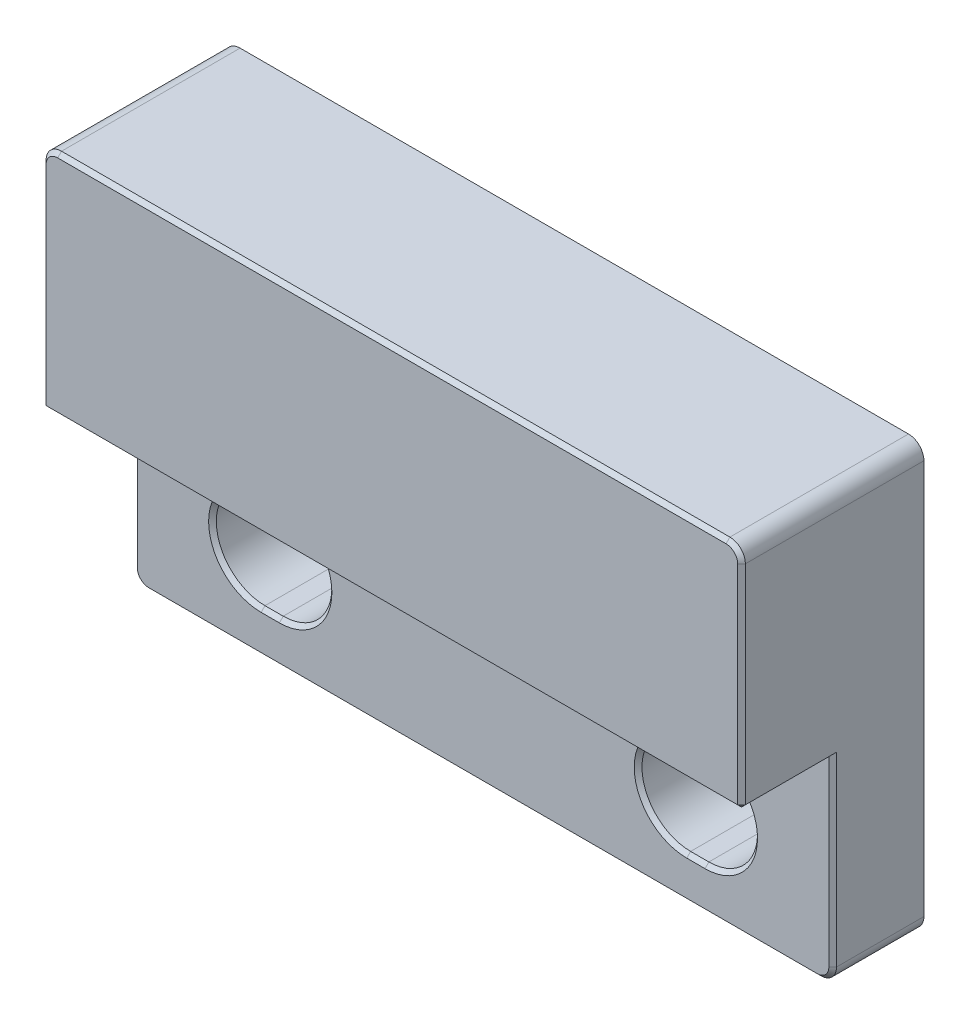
ISO-10303-21;
HEADER;
FILE_DESCRIPTION(('STEP AP214'),'2;1');
FILE_NAME('part.step','',(''),(''),'','','');
FILE_SCHEMA(('AUTOMOTIVE_DESIGN { 1 0 10303 214 1 1 1 1 }'));
ENDSEC;
DATA;
#1=APPLICATION_CONTEXT('core data for automotive mechanical design processes');
#2=APPLICATION_PROTOCOL_DEFINITION('international standard','automotive_design',2000,#1);
#3=PRODUCT_CONTEXT('',#1,'mechanical');
#4=PRODUCT('Part','Part','',(#3));
#5=PRODUCT_RELATED_PRODUCT_CATEGORY('part','',(#4));
#6=PRODUCT_DEFINITION_FORMATION('','',#4);
#7=PRODUCT_DEFINITION_CONTEXT('part definition',#1,'design');
#8=PRODUCT_DEFINITION('design','',#6,#7);
#9=PRODUCT_DEFINITION_SHAPE('','',#8);
#10=(LENGTH_UNIT() NAMED_UNIT(*) SI_UNIT(.MILLI.,.METRE.));
#11=(NAMED_UNIT(*) PLANE_ANGLE_UNIT() SI_UNIT($,.RADIAN.));
#12=(NAMED_UNIT(*) SI_UNIT($,.STERADIAN.) SOLID_ANGLE_UNIT());
#13=UNCERTAINTY_MEASURE_WITH_UNIT(LENGTH_MEASURE(1.E-05),#10,'distance_accuracy_value','');
#14=(GEOMETRIC_REPRESENTATION_CONTEXT(3) GLOBAL_UNCERTAINTY_ASSIGNED_CONTEXT((#13)) GLOBAL_UNIT_ASSIGNED_CONTEXT((#10,
#11,#12)) REPRESENTATION_CONTEXT('',''));
#15=CARTESIAN_POINT('',(0.,0.,0.));
#16=DIRECTION('',(0.,0.,1.));
#17=DIRECTION('',(1.,0.,0.));
#18=AXIS2_PLACEMENT_3D('',#15,#16,#17);
#19=CARTESIAN_POINT('',(0.,6.627,6.));
#20=DIRECTION('',(0.,-0.707106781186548,0.707106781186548));
#21=DIRECTION('',(0.,-0.707106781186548,-0.707106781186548));
#22=AXIS2_PLACEMENT_3D('',#19,#20,#21);
#23=PLANE('',#22);
#24=DIRECTION('',(0.,-0.707106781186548,-0.707106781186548));
#25=VECTOR('',#24,1.);
#26=CARTESIAN_POINT('',(22.873,6.627,6.));
#27=LINE('',#26,#25);
#28=CARTESIAN_POINT('',(22.873,6.5,5.873));
#29=VERTEX_POINT('',#28);
#30=CARTESIAN_POINT('',(22.873,6.627,6.));
#31=VERTEX_POINT('',#30);
#32=EDGE_CURVE('E532',#29,#31,#27,.F.);
#33=ORIENTED_EDGE('',*,*,#32,.T.);
#34=DIRECTION('',(1.,0.,0.));
#35=VECTOR('',#34,1.);
#36=CARTESIAN_POINT('',(0.,6.627,6.));
#37=LINE('',#36,#35);
#38=CARTESIAN_POINT('',(0.126999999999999,6.627,6.));
#39=VERTEX_POINT('',#38);
#40=EDGE_CURVE('E511',#39,#31,#37,.T.);
#41=ORIENTED_EDGE('',*,*,#40,.F.);
#42=DIRECTION('',(0.,0.707106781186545,0.70710678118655));
#43=VECTOR('',#42,1.);
#44=CARTESIAN_POINT('',(0.126999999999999,6.5,5.873));
#45=LINE('',#44,#43);
#46=CARTESIAN_POINT('',(0.126999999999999,6.5,5.873));
#47=VERTEX_POINT('',#46);
#48=EDGE_CURVE('E529',#47,#39,#45,.T.);
#49=ORIENTED_EDGE('',*,*,#48,.F.);
#50=DIRECTION('',(1.,0.,0.));
#51=VECTOR('',#50,1.);
#52=CARTESIAN_POINT('',(0.,6.5,5.873));
#53=LINE('',#52,#51);
#54=EDGE_CURVE('E486',#47,#29,#53,.T.);
#55=ORIENTED_EDGE('',*,*,#54,.T.);
#56=EDGE_LOOP('',(#33,#41,#49,#55));
#57=FACE_BOUND('',#56,.T.);
#58=ADVANCED_FACE('F15',(#57),#23,.T.);
#59=CARTESIAN_POINT('',(4.2,1.4,2.87299999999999));
#60=DIRECTION('',(0.,-0.707106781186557,-0.707106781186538));
#61=DIRECTION('',(0.,0.707106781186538,-0.707106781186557));
#62=AXIS2_PLACEMENT_3D('',#59,#60,#61);
#63=PLANE('',#62);
#64=DIRECTION('',(-1.,0.,0.));
#65=VECTOR('',#64,1.);
#66=CARTESIAN_POINT('',(0.,1.273,3.));
#67=LINE('',#66,#65);
#68=CARTESIAN_POINT('',(4.2,1.27300000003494,2.99999999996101));
#69=VERTEX_POINT('',#68);
#70=CARTESIAN_POINT('',(4.8,1.27300000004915,2.99999999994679));
#71=VERTEX_POINT('',#70);
#72=EDGE_CURVE('E476',#69,#71,#67,.F.);
#73=ORIENTED_EDGE('',*,*,#72,.T.);
#74=DIRECTION('',(0.,0.707106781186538,-0.707106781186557));
#75=VECTOR('',#74,1.);
#76=CARTESIAN_POINT('',(4.79999999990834,-498992.2,498996.473000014));
#77=LINE('',#76,#75);
#78=CARTESIAN_POINT('',(4.8,1.40000000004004,2.87299999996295));
#79=VERTEX_POINT('',#78);
#80=EDGE_CURVE('E451',#71,#79,#77,.T.);
#81=ORIENTED_EDGE('',*,*,#80,.T.);
#82=DIRECTION('',(1.,0.,0.));
#83=VECTOR('',#82,1.);
#84=CARTESIAN_POINT('',(4.2,1.4,2.87299999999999));
#85=LINE('',#84,#83);
#86=CARTESIAN_POINT('',(4.2,1.40000000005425,2.87299999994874));
#87=VERTEX_POINT('',#86);
#88=EDGE_CURVE('E444',#79,#87,#85,.F.);
#89=ORIENTED_EDGE('',*,*,#88,.T.);
#90=DIRECTION('',(0.,0.707106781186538,-0.707106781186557));
#91=VECTOR('',#90,1.);
#92=CARTESIAN_POINT('',(4.19999999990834,-498992.8,498997.073000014));
#93=LINE('',#92,#91);
#94=EDGE_CURVE('E470',#87,#69,#93,.F.);
#95=ORIENTED_EDGE('',*,*,#94,.T.);
#96=EDGE_LOOP('',(#73,#81,#89,#95));
#97=FACE_BOUND('',#96,.T.);
#98=ADVANCED_FACE('F616',(#97),#63,.F.);
#99=CARTESIAN_POINT('',(4.2,4.6,2.87299999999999));
#100=DIRECTION('',(0.,0.707106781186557,-0.707106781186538));
#101=DIRECTION('',(0.,0.707106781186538,0.707106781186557));
#102=AXIS2_PLACEMENT_3D('',#99,#100,#101);
#103=PLANE('',#102);
#104=DIRECTION('',(-1.,0.,0.));
#105=VECTOR('',#104,1.);
#106=CARTESIAN_POINT('',(0.,4.727,3.));
#107=LINE('',#106,#105);
#108=CARTESIAN_POINT('',(4.8,4.72699999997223,2.99999999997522));
#109=VERTEX_POINT('',#108);
#110=CARTESIAN_POINT('',(4.2,4.72699999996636,2.99999999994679));
#111=VERTEX_POINT('',#110);
#112=EDGE_CURVE('E479',#109,#111,#107,.T.);
#113=ORIENTED_EDGE('',*,*,#112,.T.);
#114=DIRECTION('',(0.,-0.707106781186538,-0.707106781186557));
#115=VECTOR('',#114,1.);
#116=CARTESIAN_POINT('',(4.20000000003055,498998.8,498997.073000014));
#117=LINE('',#116,#115);
#118=CARTESIAN_POINT('',(4.2,4.59999999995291,2.87299999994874));
#119=VERTEX_POINT('',#118);
#120=EDGE_CURVE('E458',#111,#119,#117,.T.);
#121=ORIENTED_EDGE('',*,*,#120,.T.);
#122=DIRECTION('',(1.,0.,0.));
#123=VECTOR('',#122,1.);
#124=CARTESIAN_POINT('',(4.2,4.6,2.87299999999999));
#125=LINE('',#124,#123);
#126=CARTESIAN_POINT('',(4.8,4.59999999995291,2.87299999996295));
#127=VERTEX_POINT('',#126);
#128=EDGE_CURVE('E439',#119,#127,#125,.T.);
#129=ORIENTED_EDGE('',*,*,#128,.T.);
#130=DIRECTION('',(0.,-0.707106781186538,-0.707106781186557));
#131=VECTOR('',#130,1.);
#132=CARTESIAN_POINT('',(4.79999999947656,498998.2,498996.473000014));
#133=LINE('',#132,#131);
#134=EDGE_CURVE('E437',#127,#109,#133,.F.);
#135=ORIENTED_EDGE('',*,*,#134,.T.);
#136=EDGE_LOOP('',(#113,#121,#129,#135));
#137=FACE_BOUND('',#136,.T.);
#138=ADVANCED_FACE('F640',(#137),#103,.F.);
#139=CARTESIAN_POINT('',(18.2,1.4,2.87299999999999));
#140=DIRECTION('',(0.,-0.707106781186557,-0.707106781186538));
#141=DIRECTION('',(0.,0.707106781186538,-0.707106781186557));
#142=AXIS2_PLACEMENT_3D('',#139,#140,#141);
#143=PLANE('',#142);
#144=DIRECTION('',(-1.,0.,0.));
#145=VECTOR('',#144,1.);
#146=CARTESIAN_POINT('',(0.,1.273,3.));
#147=LINE('',#146,#145);
#148=CARTESIAN_POINT('',(18.2,1.27300000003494,3.00000000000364));
#149=VERTEX_POINT('',#148);
#150=CARTESIAN_POINT('',(18.8,1.27300000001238,2.99999999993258));
#151=VERTEX_POINT('',#150);
#152=EDGE_CURVE('E481',#149,#151,#147,.F.);
#153=ORIENTED_EDGE('',*,*,#152,.T.);
#154=DIRECTION('',(0.,0.707106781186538,-0.707106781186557));
#155=VECTOR('',#154,1.);
#156=CARTESIAN_POINT('',(18.7999999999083,-498978.2,498982.473000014));
#157=LINE('',#156,#155);
#158=CARTESIAN_POINT('',(18.8,1.40000000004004,2.87299999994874));
#159=VERTEX_POINT('',#158);
#160=EDGE_CURVE('E409',#151,#159,#157,.T.);
#161=ORIENTED_EDGE('',*,*,#160,.T.);
#162=DIRECTION('',(1.,0.,0.));
#163=VECTOR('',#162,1.);
#164=CARTESIAN_POINT('',(18.2,1.4,2.87299999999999));
#165=LINE('',#164,#163);
#166=CARTESIAN_POINT('',(18.2,1.40000000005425,2.87299999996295));
#167=VERTEX_POINT('',#166);
#168=EDGE_CURVE('E402',#159,#167,#165,.F.);
#169=ORIENTED_EDGE('',*,*,#168,.T.);
#170=DIRECTION('',(0.,0.707106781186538,-0.707106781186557));
#171=VECTOR('',#170,1.);
#172=CARTESIAN_POINT('',(18.1999999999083,-498978.8,498983.073000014));
#173=LINE('',#172,#171);
#174=EDGE_CURVE('E428',#167,#149,#173,.F.);
#175=ORIENTED_EDGE('',*,*,#174,.T.);
#176=EDGE_LOOP('',(#153,#161,#169,#175));
#177=FACE_BOUND('',#176,.T.);
#178=ADVANCED_FACE('F782',(#177),#143,.F.);
#179=CARTESIAN_POINT('',(18.2,4.6,2.87299999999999));
#180=DIRECTION('',(0.,0.707106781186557,-0.707106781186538));
#181=DIRECTION('',(0.,0.707106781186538,0.707106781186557));
#182=AXIS2_PLACEMENT_3D('',#179,#180,#181);
#183=PLANE('',#182);
#184=DIRECTION('',(-1.,0.,0.));
#185=VECTOR('',#184,1.);
#186=CARTESIAN_POINT('',(0.,4.727,3.));
#187=LINE('',#186,#185);
#188=CARTESIAN_POINT('',(18.8,4.72700000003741,3.00000000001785));
#189=VERTEX_POINT('',#188);
#190=CARTESIAN_POINT('',(18.2,4.72699999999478,3.00000000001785));
#191=VERTEX_POINT('',#190);
#192=EDGE_CURVE('E484',#189,#191,#187,.T.);
#193=ORIENTED_EDGE('',*,*,#192,.T.);
#194=DIRECTION('',(0.,-0.707106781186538,-0.707106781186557));
#195=VECTOR('',#194,1.);
#196=CARTESIAN_POINT('',(18.2000000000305,498984.8,498983.073000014));
#197=LINE('',#196,#195);
#198=CARTESIAN_POINT('',(18.2,4.59999999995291,2.87299999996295));
#199=VERTEX_POINT('',#198);
#200=EDGE_CURVE('E416',#191,#199,#197,.T.);
#201=ORIENTED_EDGE('',*,*,#200,.T.);
#202=DIRECTION('',(1.,0.,0.));
#203=VECTOR('',#202,1.);
#204=CARTESIAN_POINT('',(18.2,4.6,2.87299999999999));
#205=LINE('',#204,#203);
#206=CARTESIAN_POINT('',(18.8,4.59999999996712,2.87299999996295));
#207=VERTEX_POINT('',#206);
#208=EDGE_CURVE('E397',#199,#207,#205,.T.);
#209=ORIENTED_EDGE('',*,*,#208,.T.);
#210=DIRECTION('',(0.,-0.707106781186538,-0.707106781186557));
#211=VECTOR('',#210,1.);
#212=CARTESIAN_POINT('',(18.8000000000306,498984.2,498982.473000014));
#213=LINE('',#212,#211);
#214=EDGE_CURVE('E394',#207,#189,#213,.F.);
#215=ORIENTED_EDGE('',*,*,#214,.T.);
#216=EDGE_LOOP('',(#193,#201,#209,#215));
#217=FACE_BOUND('',#216,.T.);
#218=ADVANCED_FACE('F778',(#217),#183,.F.);
#219=CARTESIAN_POINT('',(0.126999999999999,6.5,5.873));
#220=DIRECTION('',(-0.577350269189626,-0.577350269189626,0.577350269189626));
#221=DIRECTION('',(0.707106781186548,0.,0.707106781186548));
#222=AXIS2_PLACEMENT_3D('',#219,#220,#221);
#223=PLANE('',#222);
#224=DIRECTION('',(-0.707106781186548,0.707106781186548,0.));
#225=VECTOR('',#224,1.);
#226=CARTESIAN_POINT('',(0.126999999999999,6.5,5.873));
#227=LINE('',#226,#225);
#228=CARTESIAN_POINT('',(0.,6.627,5.873));
#229=VERTEX_POINT('',#228);
#230=EDGE_CURVE('E353',#229,#47,#227,.F.);
#231=ORIENTED_EDGE('',*,*,#230,.T.);
#232=ORIENTED_EDGE('',*,*,#48,.T.);
#233=DIRECTION('',(0.707106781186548,0.,0.707106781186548));
#234=VECTOR('',#233,1.);
#235=CARTESIAN_POINT('',(0.126999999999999,6.627,6.));
#236=LINE('',#235,#234);
#237=EDGE_CURVE('E363',#229,#39,#236,.T.);
#238=ORIENTED_EDGE('',*,*,#237,.F.);
#239=EDGE_LOOP('',(#231,#232,#238));
#240=FACE_BOUND('',#239,.T.);
#241=ADVANCED_FACE('F775',(#240),#223,.T.);
#242=CARTESIAN_POINT('',(0.508,13.492,5.87299999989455));
#243=DIRECTION('',(0.,0.,-1.));
#244=DIRECTION('',(0.,1.,0.));
#245=AXIS2_PLACEMENT_3D('',#242,#243,#244);
#246=CONICAL_SURFACE('',#245,0.508,0.785398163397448);
#247=DIRECTION('',(0.707106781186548,0.,0.707106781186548));
#248=VECTOR('',#247,1.);
#249=CARTESIAN_POINT('',(0.126999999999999,13.492,6.));
#250=LINE('',#249,#248);
#251=CARTESIAN_POINT('',(0.12699999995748,13.492,5.99999999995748));
#252=VERTEX_POINT('',#251);
#253=CARTESIAN_POINT('',(0.,13.492,5.873));
#254=VERTEX_POINT('',#253);
#255=EDGE_CURVE('E360',#252,#254,#250,.F.);
#256=ORIENTED_EDGE('',*,*,#255,.F.);
#257=CARTESIAN_POINT('',(0.508,13.492,5.99999999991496));
#258=DIRECTION('',(0.,0.,-1.));
#259=DIRECTION('',(0.,1.,0.));
#260=AXIS2_PLACEMENT_3D('',#257,#258,#259);
#261=CIRCLE('',#260,0.380999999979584);
#262=CARTESIAN_POINT('',(0.508,13.8730000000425,5.99999999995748));
#263=VERTEX_POINT('',#262);
#264=EDGE_CURVE('E18',#263,#252,#261,.F.);
#265=ORIENTED_EDGE('',*,*,#264,.F.);
#266=DIRECTION('',(0.,-0.707106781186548,0.707106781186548));
#267=VECTOR('',#266,1.);
#268=CARTESIAN_POINT('',(0.508,13.873,6.));
#269=LINE('',#268,#267);
#270=CARTESIAN_POINT('',(0.508,14.,5.873));
#271=VERTEX_POINT('',#270);
#272=EDGE_CURVE('E349',#271,#263,#269,.T.);
#273=ORIENTED_EDGE('',*,*,#272,.F.);
#274=CARTESIAN_POINT('',(0.508,13.492,5.873));
#275=DIRECTION('',(0.,0.,-1.));
#276=DIRECTION('',(-1.,0.,0.));
#277=AXIS2_PLACEMENT_3D('',#274,#275,#276);
#278=CIRCLE('',#277,0.508);
#279=EDGE_CURVE('E339',#254,#271,#278,.T.);
#280=ORIENTED_EDGE('',*,*,#279,.F.);
#281=EDGE_LOOP('',(#256,#265,#273,#280));
#282=FACE_BOUND('',#281,.T.);
#283=ADVANCED_FACE('F772',(#282),#246,.T.);
#284=CARTESIAN_POINT('',(0.,0.,6.));
#285=DIRECTION('',(0.,0.,1.));
#286=DIRECTION('',(1.,0.,0.));
#287=AXIS2_PLACEMENT_3D('',#284,#285,#286);
#288=PLANE('',#287);
#289=DIRECTION('',(0.,1.,0.));
#290=VECTOR('',#289,1.);
#291=CARTESIAN_POINT('',(0.126999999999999,0.,6.));
#292=LINE('',#291,#290);
#293=EDGE_CURVE('E522',#39,#252,#292,.T.);
#294=ORIENTED_EDGE('',*,*,#293,.F.);
#295=ORIENTED_EDGE('',*,*,#40,.T.);
#296=DIRECTION('',(0.,1.,0.));
#297=VECTOR('',#296,1.);
#298=CARTESIAN_POINT('',(22.873,0.,6.));
#299=LINE('',#298,#297);
#300=CARTESIAN_POINT('',(22.8730000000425,13.492,5.99999999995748));
#301=VERTEX_POINT('',#300);
#302=EDGE_CURVE('E322',#301,#31,#299,.F.);
#303=ORIENTED_EDGE('',*,*,#302,.F.);
#304=CARTESIAN_POINT('',(22.492,13.492,5.99999999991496));
#305=DIRECTION('',(0.,0.,-1.));
#306=DIRECTION('',(-1.,0.,0.));
#307=AXIS2_PLACEMENT_3D('',#304,#305,#306);
#308=CIRCLE('',#307,0.381000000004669);
#309=CARTESIAN_POINT('',(22.492,13.8730000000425,5.99999999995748));
#310=VERTEX_POINT('',#309);
#311=EDGE_CURVE('E493',#310,#301,#308,.T.);
#312=ORIENTED_EDGE('',*,*,#311,.F.);
#313=DIRECTION('',(1.,0.,0.));
#314=VECTOR('',#313,1.);
#315=CARTESIAN_POINT('',(0.,13.873,6.));
#316=LINE('',#315,#314);
#317=EDGE_CURVE('E352',#263,#310,#316,.T.);
#318=ORIENTED_EDGE('',*,*,#317,.F.);
#319=ORIENTED_EDGE('',*,*,#264,.T.);
#320=EDGE_LOOP('',(#294,#295,#303,#312,#318,#319));
#321=FACE_BOUND('',#320,.T.);
#322=ADVANCED_FACE('F575',(#321),#288,.T.);
#323=CARTESIAN_POINT('',(22.492,13.492,5.87300000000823));
#324=DIRECTION('',(0.,0.,-1.));
#325=DIRECTION('',(-1.,0.,0.));
#326=AXIS2_PLACEMENT_3D('',#323,#324,#325);
#327=CONICAL_SURFACE('',#326,0.507999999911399,0.785398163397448);
#328=DIRECTION('',(0.707106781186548,0.,-0.707106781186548));
#329=VECTOR('',#328,1.);
#330=CARTESIAN_POINT('',(22.873,13.492,6.));
#331=LINE('',#330,#329);
#332=CARTESIAN_POINT('',(23.,13.492,5.873));
#333=VERTEX_POINT('',#332);
#334=EDGE_CURVE('E319',#333,#301,#331,.F.);
#335=ORIENTED_EDGE('',*,*,#334,.F.);
#336=CARTESIAN_POINT('',(22.492,13.492,5.873));
#337=DIRECTION('',(0.,0.,-1.));
#338=DIRECTION('',(-1.,0.,0.));
#339=AXIS2_PLACEMENT_3D('',#336,#337,#338);
#340=CIRCLE('',#339,0.508000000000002);
#341=CARTESIAN_POINT('',(22.492,14.,5.873));
#342=VERTEX_POINT('',#341);
#343=EDGE_CURVE('E309',#342,#333,#340,.T.);
#344=ORIENTED_EDGE('',*,*,#343,.F.);
#345=DIRECTION('',(0.,-0.707106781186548,0.707106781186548));
#346=VECTOR('',#345,1.);
#347=CARTESIAN_POINT('',(22.492,13.873,6.));
#348=LINE('',#347,#346);
#349=EDGE_CURVE('E342',#310,#342,#348,.F.);
#350=ORIENTED_EDGE('',*,*,#349,.F.);
#351=ORIENTED_EDGE('',*,*,#311,.T.);
#352=EDGE_LOOP('',(#335,#344,#350,#351));
#353=FACE_BOUND('',#352,.T.);
#354=ADVANCED_FACE('F570',(#353),#327,.T.);
#355=CARTESIAN_POINT('',(0.,6.5,6.));
#356=DIRECTION('',(0.,1.,0.));
#357=DIRECTION('',(0.,0.,1.));
#358=AXIS2_PLACEMENT_3D('',#355,#356,#357);
#359=PLANE('',#358);
#360=DIRECTION('',(0.,0.,1.));
#361=VECTOR('',#360,1.);
#362=CARTESIAN_POINT('',(22.873,6.5,3.));
#363=LINE('',#362,#361);
#364=CARTESIAN_POINT('',(22.873,6.5,3.));
#365=VERTEX_POINT('',#364);
#366=EDGE_CURVE('E336',#365,#29,#363,.T.);
#367=ORIENTED_EDGE('',*,*,#366,.T.);
#368=ORIENTED_EDGE('',*,*,#54,.F.);
#369=DIRECTION('',(0.,0.,1.));
#370=VECTOR('',#369,1.);
#371=CARTESIAN_POINT('',(0.126999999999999,6.5,6.));
#372=LINE('',#371,#370);
#373=CARTESIAN_POINT('',(0.126999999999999,6.5,3.));
#374=VERTEX_POINT('',#373);
#375=EDGE_CURVE('E387',#47,#374,#372,.F.);
#376=ORIENTED_EDGE('',*,*,#375,.T.);
#377=DIRECTION('',(-1.,0.,0.));
#378=VECTOR('',#377,1.);
#379=CARTESIAN_POINT('',(0.,6.5,3.));
#380=LINE('',#379,#378);
#381=EDGE_CURVE('E113',#374,#365,#380,.F.);
#382=ORIENTED_EDGE('',*,*,#381,.T.);
#383=EDGE_LOOP('',(#367,#368,#376,#382));
#384=FACE_BOUND('',#383,.T.);
#385=ADVANCED_FACE('F763',(#384),#359,.F.);
#386=CARTESIAN_POINT('',(23.,6.627,5.873));
#387=DIRECTION('',(0.577350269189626,-0.577350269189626,0.577350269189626));
#388=DIRECTION('',(0.707106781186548,0.,-0.707106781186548));
#389=AXIS2_PLACEMENT_3D('',#386,#387,#388);
#390=PLANE('',#389);
#391=ORIENTED_EDGE('',*,*,#32,.F.);
#392=DIRECTION('',(-0.707106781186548,-0.707106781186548,0.));
#393=VECTOR('',#392,1.);
#394=CARTESIAN_POINT('',(23.,6.627,5.873));
#395=LINE('',#394,#393);
#396=CARTESIAN_POINT('',(23.,6.627,5.873));
#397=VERTEX_POINT('',#396);
#398=EDGE_CURVE('E296',#29,#397,#395,.F.);
#399=ORIENTED_EDGE('',*,*,#398,.T.);
#400=DIRECTION('',(0.707106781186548,0.,-0.707106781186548));
#401=VECTOR('',#400,1.);
#402=CARTESIAN_POINT('',(22.873,6.627,6.));
#403=LINE('',#402,#401);
#404=EDGE_CURVE('E312',#31,#397,#403,.T.);
#405=ORIENTED_EDGE('',*,*,#404,.F.);
#406=EDGE_LOOP('',(#391,#399,#405));
#407=FACE_BOUND('',#406,.T.);
#408=ADVANCED_FACE('F760',(#407),#390,.T.);
#409=CARTESIAN_POINT('',(0.,0.,3.));
#410=DIRECTION('',(0.,0.,-1.));
#411=DIRECTION('',(-1.,0.,0.));
#412=AXIS2_PLACEMENT_3D('',#409,#410,#411);
#413=PLANE('',#412);
#414=DIRECTION('',(0.,1.,0.));
#415=VECTOR('',#414,1.);
#416=CARTESIAN_POINT('',(22.873,0.,3.));
#417=LINE('',#416,#415);
#418=CARTESIAN_POINT('',(22.8729999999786,0.508,3.00000000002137));
#419=VERTEX_POINT('',#418);
#420=EDGE_CURVE('E303',#419,#365,#417,.T.);
#421=ORIENTED_EDGE('',*,*,#420,.T.);
#422=ORIENTED_EDGE('',*,*,#381,.F.);
#423=DIRECTION('',(0.,1.,0.));
#424=VECTOR('',#423,1.);
#425=CARTESIAN_POINT('',(0.126999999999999,0.,3.));
#426=LINE('',#425,#424);
#427=CARTESIAN_POINT('',(0.126999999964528,0.508,2.99999999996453));
#428=VERTEX_POINT('',#427);
#429=EDGE_CURVE('E377',#374,#428,#426,.F.);
#430=ORIENTED_EDGE('',*,*,#429,.T.);
#431=CARTESIAN_POINT('',(0.508,0.508,2.99999999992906));
#432=DIRECTION('',(0.,0.,-1.));
#433=DIRECTION('',(-1.,0.,0.));
#434=AXIS2_PLACEMENT_3D('',#431,#432,#433);
#435=CIRCLE('',#434,0.380999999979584);
#436=CARTESIAN_POINT('',(0.508,0.126999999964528,2.99999999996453));
#437=VERTEX_POINT('',#436);
#438=EDGE_CURVE('E504',#437,#428,#435,.T.);
#439=ORIENTED_EDGE('',*,*,#438,.F.);
#440=DIRECTION('',(1.,0.,0.));
#441=VECTOR('',#440,1.);
#442=CARTESIAN_POINT('',(0.,0.126999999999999,3.));
#443=LINE('',#442,#441);
#444=CARTESIAN_POINT('',(22.492,0.127000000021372,3.00000000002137));
#445=VERTEX_POINT('',#444);
#446=EDGE_CURVE('E286',#437,#445,#443,.T.);
#447=ORIENTED_EDGE('',*,*,#446,.T.);
#448=CARTESIAN_POINT('',(22.492,0.508,3.00000000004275));
#449=DIRECTION('',(0.,0.,-1.));
#450=DIRECTION('',(-1.,0.,0.));
#451=AXIS2_PLACEMENT_3D('',#448,#449,#450);
#452=CIRCLE('',#451,0.381000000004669);
#453=EDGE_CURVE('E472',#419,#445,#452,.T.);
#454=ORIENTED_EDGE('',*,*,#453,.F.);
#455=EDGE_LOOP('',(#421,#422,#430,#439,#447,#454));
#456=FACE_BOUND('',#455,.T.);
#457=CARTESIAN_POINT('',(4.8,3.,2.9999999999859));
#458=DIRECTION('',(0.,0.,1.));
#459=DIRECTION('',(1.,0.,0.));
#460=AXIS2_PLACEMENT_3D('',#457,#458,#459);
#461=CIRCLE('',#460,1.72699999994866);
#462=EDGE_CURVE('E430',#109,#71,#461,.F.);
#463=ORIENTED_EDGE('',*,*,#462,.T.);
#464=ORIENTED_EDGE('',*,*,#72,.F.);
#465=CARTESIAN_POINT('',(4.2,3.,2.9999999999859));
#466=DIRECTION('',(0.,0.,1.));
#467=DIRECTION('',(1.,0.,0.));
#468=AXIS2_PLACEMENT_3D('',#465,#466,#467);
#469=CIRCLE('',#468,1.72699999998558);
#470=EDGE_CURVE('E467',#69,#111,#469,.F.);
#471=ORIENTED_EDGE('',*,*,#470,.T.);
#472=ORIENTED_EDGE('',*,*,#112,.F.);
#473=EDGE_LOOP('',(#463,#464,#471,#472));
#474=FACE_BOUND('',#473,.T.);
#475=CARTESIAN_POINT('',(18.8,3.,3.00000000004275));
#476=DIRECTION('',(0.,0.,1.));
#477=DIRECTION('',(0.,-1.,0.));
#478=AXIS2_PLACEMENT_3D('',#475,#476,#477);
#479=CIRCLE('',#478,1.72700000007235);
#480=EDGE_CURVE('E396',#189,#151,#479,.F.);
#481=ORIENTED_EDGE('',*,*,#480,.T.);
#482=ORIENTED_EDGE('',*,*,#152,.F.);
#483=CARTESIAN_POINT('',(18.2,3.,3.00000000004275));
#484=DIRECTION('',(0.,0.,1.));
#485=DIRECTION('',(0.,-1.,0.));
#486=AXIS2_PLACEMENT_3D('',#483,#484,#485);
#487=CIRCLE('',#486,1.72699999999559);
#488=EDGE_CURVE('E425',#149,#191,#487,.F.);
#489=ORIENTED_EDGE('',*,*,#488,.T.);
#490=ORIENTED_EDGE('',*,*,#192,.F.);
#491=EDGE_LOOP('',(#481,#482,#489,#490));
#492=FACE_BOUND('',#491,.T.);
#493=ADVANCED_FACE('F644',(#456,#474,#492),#413,.F.);
#494=CARTESIAN_POINT('',(0.508,0.508,2.87300000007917));
#495=DIRECTION('',(0.,0.,-1.));
#496=DIRECTION('',(-1.,0.,0.));
#497=AXIS2_PLACEMENT_3D('',#494,#495,#496);
#498=CONICAL_SURFACE('',#497,0.507999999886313,0.785398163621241);
#499=DIRECTION('',(0.,0.707106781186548,0.707106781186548));
#500=VECTOR('',#499,1.);
#501=CARTESIAN_POINT('',(0.508,0.126999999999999,3.));
#502=LINE('',#501,#500);
#503=CARTESIAN_POINT('',(0.508,0.,2.873));
#504=VERTEX_POINT('',#503);
#505=EDGE_CURVE('E276',#504,#437,#502,.T.);
#506=ORIENTED_EDGE('',*,*,#505,.T.);
#507=ORIENTED_EDGE('',*,*,#438,.T.);
#508=DIRECTION('',(-0.707106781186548,0.,-0.707106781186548));
#509=VECTOR('',#508,1.);
#510=CARTESIAN_POINT('',(0.126999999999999,0.508,3.));
#511=LINE('',#510,#509);
#512=CARTESIAN_POINT('',(0.,0.508,2.873));
#513=VERTEX_POINT('',#512);
#514=EDGE_CURVE('E364',#428,#513,#511,.T.);
#515=ORIENTED_EDGE('',*,*,#514,.T.);
#516=CARTESIAN_POINT('',(0.508,0.508,2.873));
#517=DIRECTION('',(0.,0.,-1.));
#518=DIRECTION('',(-1.,0.,0.));
#519=AXIS2_PLACEMENT_3D('',#516,#517,#518);
#520=CIRCLE('',#519,0.508);
#521=EDGE_CURVE('E293',#504,#513,#520,.T.);
#522=ORIENTED_EDGE('',*,*,#521,.F.);
#523=EDGE_LOOP('',(#506,#507,#515,#522));
#524=FACE_BOUND('',#523,.T.);
#525=ADVANCED_FACE('F753',(#524),#498,.T.);
#526=CARTESIAN_POINT('',(22.492,0.508,2.87300000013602));
#527=DIRECTION('',(0.,0.,-1.));
#528=DIRECTION('',(-1.,0.,0.));
#529=AXIS2_PLACEMENT_3D('',#526,#527,#528);
#530=CONICAL_SURFACE('',#529,0.507999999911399,0.785398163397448);
#531=DIRECTION('',(-0.707106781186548,0.,0.707106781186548));
#532=VECTOR('',#531,1.);
#533=CARTESIAN_POINT('',(22.873,0.508,3.));
#534=LINE('',#533,#532);
#535=CARTESIAN_POINT('',(23.,0.508,2.873));
#536=VERTEX_POINT('',#535);
#537=EDGE_CURVE('E299',#536,#419,#534,.T.);
#538=ORIENTED_EDGE('',*,*,#537,.T.);
#539=ORIENTED_EDGE('',*,*,#453,.T.);
#540=DIRECTION('',(0.,0.707106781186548,0.707106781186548));
#541=VECTOR('',#540,1.);
#542=CARTESIAN_POINT('',(22.492,0.126999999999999,3.));
#543=LINE('',#542,#541);
#544=CARTESIAN_POINT('',(22.492,0.,2.873));
#545=VERTEX_POINT('',#544);
#546=EDGE_CURVE('E283',#445,#545,#543,.F.);
#547=ORIENTED_EDGE('',*,*,#546,.T.);
#548=CARTESIAN_POINT('',(22.492,0.508,2.873));
#549=DIRECTION('',(0.,0.,-1.));
#550=DIRECTION('',(-1.,0.,0.));
#551=AXIS2_PLACEMENT_3D('',#548,#549,#550);
#552=CIRCLE('',#551,0.508000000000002);
#553=EDGE_CURVE('E168',#536,#545,#552,.T.);
#554=ORIENTED_EDGE('',*,*,#553,.F.);
#555=EDGE_LOOP('',(#538,#539,#547,#554));
#556=FACE_BOUND('',#555,.T.);
#557=ADVANCED_FACE('F750',(#556),#530,.T.);
#558=CARTESIAN_POINT('',(4.2,3.,2.99999999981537));
#559=DIRECTION('',(0.,0.,1.));
#560=DIRECTION('',(1.,0.,0.));
#561=AXIS2_PLACEMENT_3D('',#558,#559,#560);
#562=CONICAL_SURFACE('',#561,1.72699999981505,0.785398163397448);
#563=ORIENTED_EDGE('',*,*,#470,.F.);
#564=ORIENTED_EDGE('',*,*,#94,.F.);
#565=CARTESIAN_POINT('',(4.2,3.,2.87299999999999));
#566=DIRECTION('',(0.,0.,1.));
#567=DIRECTION('',(1.,0.,0.));
#568=AXIS2_PLACEMENT_3D('',#565,#566,#567);
#569=CIRCLE('',#568,1.6);
#570=EDGE_CURVE('E268',#87,#119,#569,.F.);
#571=ORIENTED_EDGE('',*,*,#570,.T.);
#572=ORIENTED_EDGE('',*,*,#120,.F.);
#573=EDGE_LOOP('',(#563,#564,#571,#572));
#574=FACE_BOUND('',#573,.T.);
#575=ADVANCED_FACE('F629',(#574),#562,.F.);
#576=CARTESIAN_POINT('',(4.2,1.4,0.));
#577=DIRECTION('',(0.,-1.,0.));
#578=DIRECTION('',(1.,0.,0.));
#579=AXIS2_PLACEMENT_3D('',#576,#577,#578);
#580=PLANE('',#579);
#581=ORIENTED_EDGE('',*,*,#88,.F.);
#582=DIRECTION('',(0.,0.,1.));
#583=VECTOR('',#582,1.);
#584=CARTESIAN_POINT('',(4.8,1.4,0.));
#585=LINE('',#584,#583);
#586=CARTESIAN_POINT('',(4.8,1.4,0.));
#587=VERTEX_POINT('',#586);
#588=EDGE_CURVE('E258',#79,#587,#585,.F.);
#589=ORIENTED_EDGE('',*,*,#588,.T.);
#590=DIRECTION('',(1.,0.,0.));
#591=VECTOR('',#590,1.);
#592=CARTESIAN_POINT('',(4.2,1.4,0.));
#593=LINE('',#592,#591);
#594=CARTESIAN_POINT('',(4.2,1.4,0.));
#595=VERTEX_POINT('',#594);
#596=EDGE_CURVE('E449',#595,#587,#593,.T.);
#597=ORIENTED_EDGE('',*,*,#596,.F.);
#598=DIRECTION('',(0.,0.,1.));
#599=VECTOR('',#598,1.);
#600=CARTESIAN_POINT('',(4.2,1.4,0.));
#601=LINE('',#600,#599);
#602=EDGE_CURVE('E167',#595,#87,#601,.T.);
#603=ORIENTED_EDGE('',*,*,#602,.T.);
#604=EDGE_LOOP('',(#581,#589,#597,#603));
#605=FACE_BOUND('',#604,.T.);
#606=ADVANCED_FACE('F623',(#605),#580,.F.);
#607=CARTESIAN_POINT('',(4.2,4.6,0.));
#608=DIRECTION('',(0.,1.,0.));
#609=DIRECTION('',(0.,0.,1.));
#610=AXIS2_PLACEMENT_3D('',#607,#608,#609);
#611=PLANE('',#610);
#612=ORIENTED_EDGE('',*,*,#128,.F.);
#613=DIRECTION('',(0.,0.,1.));
#614=VECTOR('',#613,1.);
#615=CARTESIAN_POINT('',(4.2,4.6,0.));
#616=LINE('',#615,#614);
#617=CARTESIAN_POINT('',(4.2,4.6,0.));
#618=VERTEX_POINT('',#617);
#619=EDGE_CURVE('E263',#119,#618,#616,.F.);
#620=ORIENTED_EDGE('',*,*,#619,.T.);
#621=DIRECTION('',(1.,0.,0.));
#622=VECTOR('',#621,1.);
#623=CARTESIAN_POINT('',(4.2,4.6,0.));
#624=LINE('',#623,#622);
#625=CARTESIAN_POINT('',(4.8,4.6,0.));
#626=VERTEX_POINT('',#625);
#627=EDGE_CURVE('E442',#626,#618,#624,.F.);
#628=ORIENTED_EDGE('',*,*,#627,.F.);
#629=DIRECTION('',(0.,0.,1.));
#630=VECTOR('',#629,1.);
#631=CARTESIAN_POINT('',(4.8,4.6,0.));
#632=LINE('',#631,#630);
#633=EDGE_CURVE('E255',#626,#127,#632,.T.);
#634=ORIENTED_EDGE('',*,*,#633,.T.);
#635=EDGE_LOOP('',(#612,#620,#628,#634));
#636=FACE_BOUND('',#635,.T.);
#637=ADVANCED_FACE('F636',(#636),#611,.F.);
#638=CARTESIAN_POINT('',(4.8,3.,2.99999999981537));
#639=DIRECTION('',(0.,0.,1.));
#640=DIRECTION('',(1.,0.,0.));
#641=AXIS2_PLACEMENT_3D('',#638,#639,#640);
#642=CONICAL_SURFACE('',#641,1.72699999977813,0.785398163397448);
#643=CARTESIAN_POINT('',(4.8,3.,2.87299999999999));
#644=DIRECTION('',(0.,0.,1.));
#645=DIRECTION('',(1.,0.,0.));
#646=AXIS2_PLACEMENT_3D('',#643,#644,#645);
#647=CIRCLE('',#646,1.6);
#648=EDGE_CURVE('E252',#127,#79,#647,.F.);
#649=ORIENTED_EDGE('',*,*,#648,.T.);
#650=ORIENTED_EDGE('',*,*,#80,.F.);
#651=ORIENTED_EDGE('',*,*,#462,.F.);
#652=ORIENTED_EDGE('',*,*,#134,.F.);
#653=EDGE_LOOP('',(#649,#650,#651,#652));
#654=FACE_BOUND('',#653,.T.);
#655=ADVANCED_FACE('F647',(#654),#642,.F.);
#656=CARTESIAN_POINT('',(18.2,3.,2.99999999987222));
#657=DIRECTION('',(0.,0.,1.));
#658=DIRECTION('',(0.,-1.,0.));
#659=AXIS2_PLACEMENT_3D('',#656,#657,#658);
#660=CONICAL_SURFACE('',#659,1.72699999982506,0.785398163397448);
#661=ORIENTED_EDGE('',*,*,#488,.F.);
#662=ORIENTED_EDGE('',*,*,#174,.F.);
#663=CARTESIAN_POINT('',(18.2,3.,2.87299999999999));
#664=DIRECTION('',(0.,0.,1.));
#665=DIRECTION('',(1.,0.,0.));
#666=AXIS2_PLACEMENT_3D('',#663,#664,#665);
#667=CIRCLE('',#666,1.6);
#668=EDGE_CURVE('E246',#167,#199,#667,.F.);
#669=ORIENTED_EDGE('',*,*,#668,.T.);
#670=ORIENTED_EDGE('',*,*,#200,.F.);
#671=EDGE_LOOP('',(#661,#662,#669,#670));
#672=FACE_BOUND('',#671,.T.);
#673=ADVANCED_FACE('F737',(#672),#660,.F.);
#674=CARTESIAN_POINT('',(18.2,1.4,0.));
#675=DIRECTION('',(0.,-1.,0.));
#676=DIRECTION('',(1.,0.,0.));
#677=AXIS2_PLACEMENT_3D('',#674,#675,#676);
#678=PLANE('',#677);
#679=ORIENTED_EDGE('',*,*,#168,.F.);
#680=DIRECTION('',(0.,0.,1.));
#681=VECTOR('',#680,1.);
#682=CARTESIAN_POINT('',(18.8,1.4,0.));
#683=LINE('',#682,#681);
#684=CARTESIAN_POINT('',(18.8,1.4,0.));
#685=VERTEX_POINT('',#684);
#686=EDGE_CURVE('E236',#159,#685,#683,.F.);
#687=ORIENTED_EDGE('',*,*,#686,.T.);
#688=DIRECTION('',(1.,0.,0.));
#689=VECTOR('',#688,1.);
#690=CARTESIAN_POINT('',(18.2,1.4,0.));
#691=LINE('',#690,#689);
#692=CARTESIAN_POINT('',(18.2,1.4,0.));
#693=VERTEX_POINT('',#692);
#694=EDGE_CURVE('E407',#693,#685,#691,.T.);
#695=ORIENTED_EDGE('',*,*,#694,.F.);
#696=DIRECTION('',(0.,0.,1.));
#697=VECTOR('',#696,1.);
#698=CARTESIAN_POINT('',(18.2,1.4,0.));
#699=LINE('',#698,#697);
#700=EDGE_CURVE('E249',#693,#167,#699,.T.);
#701=ORIENTED_EDGE('',*,*,#700,.T.);
#702=EDGE_LOOP('',(#679,#687,#695,#701));
#703=FACE_BOUND('',#702,.T.);
#704=ADVANCED_FACE('F733',(#703),#678,.F.);
#705=CARTESIAN_POINT('',(18.2,4.6,0.));
#706=DIRECTION('',(0.,1.,0.));
#707=DIRECTION('',(0.,0.,1.));
#708=AXIS2_PLACEMENT_3D('',#705,#706,#707);
#709=PLANE('',#708);
#710=ORIENTED_EDGE('',*,*,#208,.F.);
#711=DIRECTION('',(0.,0.,1.));
#712=VECTOR('',#711,1.);
#713=CARTESIAN_POINT('',(18.2,4.6,0.));
#714=LINE('',#713,#712);
#715=CARTESIAN_POINT('',(18.2,4.6,0.));
#716=VERTEX_POINT('',#715);
#717=EDGE_CURVE('E241',#199,#716,#714,.F.);
#718=ORIENTED_EDGE('',*,*,#717,.T.);
#719=DIRECTION('',(1.,0.,0.));
#720=VECTOR('',#719,1.);
#721=CARTESIAN_POINT('',(18.2,4.6,0.));
#722=LINE('',#721,#720);
#723=CARTESIAN_POINT('',(18.8,4.6,0.));
#724=VERTEX_POINT('',#723);
#725=EDGE_CURVE('E400',#724,#716,#722,.F.);
#726=ORIENTED_EDGE('',*,*,#725,.F.);
#727=DIRECTION('',(0.,0.,1.));
#728=VECTOR('',#727,1.);
#729=CARTESIAN_POINT('',(18.8,4.6,0.));
#730=LINE('',#729,#728);
#731=EDGE_CURVE('E232',#724,#207,#730,.T.);
#732=ORIENTED_EDGE('',*,*,#731,.T.);
#733=EDGE_LOOP('',(#710,#718,#726,#732));
#734=FACE_BOUND('',#733,.T.);
#735=ADVANCED_FACE('F729',(#734),#709,.F.);
#736=CARTESIAN_POINT('',(18.8,3.,2.99999999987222));
#737=DIRECTION('',(0.,0.,1.));
#738=DIRECTION('',(0.,-1.,0.));
#739=AXIS2_PLACEMENT_3D('',#736,#737,#738);
#740=CONICAL_SURFACE('',#739,1.72699999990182,0.785398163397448);
#741=CARTESIAN_POINT('',(18.8,3.,2.87299999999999));
#742=DIRECTION('',(0.,0.,1.));
#743=DIRECTION('',(1.,0.,0.));
#744=AXIS2_PLACEMENT_3D('',#741,#742,#743);
#745=CIRCLE('',#744,1.6);
#746=EDGE_CURVE('E235',#207,#159,#745,.F.);
#747=ORIENTED_EDGE('',*,*,#746,.T.);
#748=ORIENTED_EDGE('',*,*,#160,.F.);
#749=ORIENTED_EDGE('',*,*,#480,.F.);
#750=ORIENTED_EDGE('',*,*,#214,.F.);
#751=EDGE_LOOP('',(#747,#748,#749,#750));
#752=FACE_BOUND('',#751,.T.);
#753=ADVANCED_FACE('F725',(#752),#740,.F.);
#754=CARTESIAN_POINT('',(0.126999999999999,0.,3.));
#755=DIRECTION('',(0.707106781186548,0.,-0.707106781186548));
#756=DIRECTION('',(-0.707106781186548,0.,-0.707106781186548));
#757=AXIS2_PLACEMENT_3D('',#754,#755,#756);
#758=PLANE('',#757);
#759=DIRECTION('',(0.,1.,0.));
#760=VECTOR('',#759,1.);
#761=CARTESIAN_POINT('',(0.,0.,2.873));
#762=LINE('',#761,#760);
#763=CARTESIAN_POINT('',(0.,6.627,2.873));
#764=VERTEX_POINT('',#763);
#765=EDGE_CURVE('E224',#764,#513,#762,.F.);
#766=ORIENTED_EDGE('',*,*,#765,.T.);
#767=ORIENTED_EDGE('',*,*,#514,.F.);
#768=ORIENTED_EDGE('',*,*,#429,.F.);
#769=DIRECTION('',(-0.577350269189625,0.577350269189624,-0.577350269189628));
#770=VECTOR('',#769,1.);
#771=CARTESIAN_POINT('',(0.126999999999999,6.5,3.));
#772=LINE('',#771,#770);
#773=EDGE_CURVE('E384',#374,#764,#772,.T.);
#774=ORIENTED_EDGE('',*,*,#773,.T.);
#775=EDGE_LOOP('',(#766,#767,#768,#774));
#776=FACE_BOUND('',#775,.T.);
#777=ADVANCED_FACE('F721',(#776),#758,.F.);
#778=CARTESIAN_POINT('',(0.126999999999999,0.,6.));
#779=DIRECTION('',(-0.707106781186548,0.,0.707106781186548));
#780=DIRECTION('',(0.707106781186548,0.,0.707106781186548));
#781=AXIS2_PLACEMENT_3D('',#778,#779,#780);
#782=PLANE('',#781);
#783=ORIENTED_EDGE('',*,*,#237,.T.);
#784=ORIENTED_EDGE('',*,*,#293,.T.);
#785=ORIENTED_EDGE('',*,*,#255,.T.);
#786=DIRECTION('',(0.,1.,0.));
#787=VECTOR('',#786,1.);
#788=CARTESIAN_POINT('',(0.,0.,5.873));
#789=LINE('',#788,#787);
#790=EDGE_CURVE('E229',#254,#229,#789,.F.);
#791=ORIENTED_EDGE('',*,*,#790,.T.);
#792=EDGE_LOOP('',(#783,#784,#785,#791));
#793=FACE_BOUND('',#792,.T.);
#794=ADVANCED_FACE('F717',(#793),#782,.T.);
#795=CARTESIAN_POINT('',(0.126999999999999,6.5,6.));
#796=DIRECTION('',(0.707106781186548,0.707106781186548,0.));
#797=DIRECTION('',(-0.707106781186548,0.707106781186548,0.));
#798=AXIS2_PLACEMENT_3D('',#795,#796,#797);
#799=PLANE('',#798);
#800=DIRECTION('',(0.,0.,-1.));
#801=VECTOR('',#800,1.);
#802=CARTESIAN_POINT('',(0.,6.627,3.));
#803=LINE('',#802,#801);
#804=EDGE_CURVE('E218',#229,#764,#803,.T.);
#805=ORIENTED_EDGE('',*,*,#804,.T.);
#806=ORIENTED_EDGE('',*,*,#773,.F.);
#807=ORIENTED_EDGE('',*,*,#375,.F.);
#808=ORIENTED_EDGE('',*,*,#230,.F.);
#809=EDGE_LOOP('',(#805,#806,#807,#808));
#810=FACE_BOUND('',#809,.T.);
#811=ADVANCED_FACE('F713',(#810),#799,.F.);
#812=CARTESIAN_POINT('',(0.,13.873,6.));
#813=DIRECTION('',(0.,0.707106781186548,0.707106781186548));
#814=DIRECTION('',(0.,-0.707106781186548,0.707106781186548));
#815=AXIS2_PLACEMENT_3D('',#812,#813,#814);
#816=PLANE('',#815);
#817=ORIENTED_EDGE('',*,*,#349,.T.);
#818=DIRECTION('',(1.,0.,0.));
#819=VECTOR('',#818,1.);
#820=CARTESIAN_POINT('',(0.,14.,5.873));
#821=LINE('',#820,#819);
#822=EDGE_CURVE('E212',#342,#271,#821,.F.);
#823=ORIENTED_EDGE('',*,*,#822,.T.);
#824=ORIENTED_EDGE('',*,*,#272,.T.);
#825=ORIENTED_EDGE('',*,*,#317,.T.);
#826=EDGE_LOOP('',(#817,#823,#824,#825));
#827=FACE_BOUND('',#826,.T.);
#828=ADVANCED_FACE('F709',(#827),#816,.T.);
#829=CARTESIAN_POINT('',(0.508,13.492,3.));
#830=DIRECTION('',(0.,0.,-1.));
#831=DIRECTION('',(-1.,0.,0.));
#832=AXIS2_PLACEMENT_3D('',#829,#830,#831);
#833=CYLINDRICAL_SURFACE('',#832,0.508);
#834=DIRECTION('',(0.,0.,-1.));
#835=VECTOR('',#834,1.);
#836=CARTESIAN_POINT('',(0.508,14.,3.));
#837=LINE('',#836,#835);
#838=CARTESIAN_POINT('',(0.508,14.,0.));
#839=VERTEX_POINT('',#838);
#840=EDGE_CURVE('E209',#271,#839,#837,.T.);
#841=ORIENTED_EDGE('',*,*,#840,.T.);
#842=CARTESIAN_POINT('',(0.508,13.492,0.));
#843=DIRECTION('',(0.,0.,-1.));
#844=DIRECTION('',(-1.,0.,0.));
#845=AXIS2_PLACEMENT_3D('',#842,#843,#844);
#846=CIRCLE('',#845,0.508);
#847=CARTESIAN_POINT('',(0.,13.492,0.));
#848=VERTEX_POINT('',#847);
#849=EDGE_CURVE('E323',#839,#848,#846,.F.);
#850=ORIENTED_EDGE('',*,*,#849,.T.);
#851=DIRECTION('',(0.,0.,-1.));
#852=VECTOR('',#851,1.);
#853=CARTESIAN_POINT('',(0.,13.492,3.));
#854=LINE('',#853,#852);
#855=EDGE_CURVE('E223',#848,#254,#854,.F.);
#856=ORIENTED_EDGE('',*,*,#855,.T.);
#857=ORIENTED_EDGE('',*,*,#279,.T.);
#858=EDGE_LOOP('',(#841,#850,#856,#857));
#859=FACE_BOUND('',#858,.T.);
#860=ADVANCED_FACE('F706',(#859),#833,.T.);
#861=CARTESIAN_POINT('',(22.873,0.,6.));
#862=DIRECTION('',(0.707106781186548,0.,0.707106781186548));
#863=DIRECTION('',(0.707106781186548,0.,-0.707106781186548));
#864=AXIS2_PLACEMENT_3D('',#861,#862,#863);
#865=PLANE('',#864);
#866=ORIENTED_EDGE('',*,*,#404,.T.);
#867=DIRECTION('',(0.,1.,0.));
#868=VECTOR('',#867,1.);
#869=CARTESIAN_POINT('',(23.,0.,5.873));
#870=LINE('',#869,#868);
#871=EDGE_CURVE('E204',#397,#333,#870,.T.);
#872=ORIENTED_EDGE('',*,*,#871,.T.);
#873=ORIENTED_EDGE('',*,*,#334,.T.);
#874=ORIENTED_EDGE('',*,*,#302,.T.);
#875=EDGE_LOOP('',(#866,#872,#873,#874));
#876=FACE_BOUND('',#875,.T.);
#877=ADVANCED_FACE('F578',(#876),#865,.T.);
#878=CARTESIAN_POINT('',(22.492,13.492,3.));
#879=DIRECTION('',(0.,0.,-1.));
#880=DIRECTION('',(-1.,0.,0.));
#881=AXIS2_PLACEMENT_3D('',#878,#879,#880);
#882=CYLINDRICAL_SURFACE('',#881,0.508000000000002);
#883=DIRECTION('',(0.,0.,1.));
#884=VECTOR('',#883,1.);
#885=CARTESIAN_POINT('',(23.,13.492,3.));
#886=LINE('',#885,#884);
#887=CARTESIAN_POINT('',(23.,13.492,0.));
#888=VERTEX_POINT('',#887);
#889=EDGE_CURVE('E178',#333,#888,#886,.F.);
#890=ORIENTED_EDGE('',*,*,#889,.T.);
#891=CARTESIAN_POINT('',(22.492,13.492,0.));
#892=DIRECTION('',(0.,0.,-1.));
#893=DIRECTION('',(-1.,0.,0.));
#894=AXIS2_PLACEMENT_3D('',#891,#892,#893);
#895=CIRCLE('',#894,0.508000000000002);
#896=CARTESIAN_POINT('',(22.492,14.,0.));
#897=VERTEX_POINT('',#896);
#898=EDGE_CURVE('E183',#888,#897,#895,.F.);
#899=ORIENTED_EDGE('',*,*,#898,.T.);
#900=DIRECTION('',(0.,0.,-1.));
#901=VECTOR('',#900,1.);
#902=CARTESIAN_POINT('',(22.492,14.,3.));
#903=LINE('',#902,#901);
#904=EDGE_CURVE('E215',#897,#342,#903,.F.);
#905=ORIENTED_EDGE('',*,*,#904,.T.);
#906=ORIENTED_EDGE('',*,*,#343,.T.);
#907=EDGE_LOOP('',(#890,#899,#905,#906));
#908=FACE_BOUND('',#907,.T.);
#909=ADVANCED_FACE('F583',(#908),#882,.T.);
#910=CARTESIAN_POINT('',(22.873,0.,3.));
#911=DIRECTION('',(-0.707106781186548,0.,-0.707106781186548));
#912=DIRECTION('',(-0.707106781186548,0.,0.707106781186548));
#913=AXIS2_PLACEMENT_3D('',#910,#911,#912);
#914=PLANE('',#913);
#915=DIRECTION('',(0.,1.,0.));
#916=VECTOR('',#915,1.);
#917=CARTESIAN_POINT('',(23.,0.,2.873));
#918=LINE('',#917,#916);
#919=CARTESIAN_POINT('',(23.,6.627,2.873));
#920=VERTEX_POINT('',#919);
#921=EDGE_CURVE('E177',#536,#920,#918,.T.);
#922=ORIENTED_EDGE('',*,*,#921,.T.);
#923=DIRECTION('',(-0.577350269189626,-0.577350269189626,0.577350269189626));
#924=VECTOR('',#923,1.);
#925=CARTESIAN_POINT('',(23.,6.627,2.873));
#926=LINE('',#925,#924);
#927=EDGE_CURVE('E302',#920,#365,#926,.T.);
#928=ORIENTED_EDGE('',*,*,#927,.T.);
#929=ORIENTED_EDGE('',*,*,#420,.F.);
#930=ORIENTED_EDGE('',*,*,#537,.F.);
#931=EDGE_LOOP('',(#922,#928,#929,#930));
#932=FACE_BOUND('',#931,.T.);
#933=ADVANCED_FACE('F697',(#932),#914,.F.);
#934=CARTESIAN_POINT('',(23.,6.627,3.));
#935=DIRECTION('',(-0.707106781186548,0.707106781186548,0.));
#936=DIRECTION('',(-0.707106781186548,-0.707106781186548,0.));
#937=AXIS2_PLACEMENT_3D('',#934,#935,#936);
#938=PLANE('',#937);
#939=ORIENTED_EDGE('',*,*,#366,.F.);
#940=ORIENTED_EDGE('',*,*,#927,.F.);
#941=DIRECTION('',(0.,0.,1.));
#942=VECTOR('',#941,1.);
#943=CARTESIAN_POINT('',(23.,6.627,3.));
#944=LINE('',#943,#942);
#945=EDGE_CURVE('E200',#920,#397,#944,.T.);
#946=ORIENTED_EDGE('',*,*,#945,.T.);
#947=ORIENTED_EDGE('',*,*,#398,.F.);
#948=EDGE_LOOP('',(#939,#940,#946,#947));
#949=FACE_BOUND('',#948,.T.);
#950=ADVANCED_FACE('F694',(#949),#938,.F.);
#951=CARTESIAN_POINT('',(0.508,0.508,3.));
#952=DIRECTION('',(0.,0.,-1.));
#953=DIRECTION('',(-1.,0.,0.));
#954=AXIS2_PLACEMENT_3D('',#951,#952,#953);
#955=CYLINDRICAL_SURFACE('',#954,0.508);
#956=DIRECTION('',(0.,0.,-1.));
#957=VECTOR('',#956,1.);
#958=CARTESIAN_POINT('',(0.,0.508,3.));
#959=LINE('',#958,#957);
#960=CARTESIAN_POINT('',(0.,0.508,0.));
#961=VERTEX_POINT('',#960);
#962=EDGE_CURVE('E221',#513,#961,#959,.T.);
#963=ORIENTED_EDGE('',*,*,#962,.T.);
#964=CARTESIAN_POINT('',(0.508,0.508,0.));
#965=DIRECTION('',(0.,0.,-1.));
#966=DIRECTION('',(-1.,0.,0.));
#967=AXIS2_PLACEMENT_3D('',#964,#965,#966);
#968=CIRCLE('',#967,0.508);
#969=CARTESIAN_POINT('',(0.508,0.,0.));
#970=VERTEX_POINT('',#969);
#971=EDGE_CURVE('E33',#961,#970,#968,.F.);
#972=ORIENTED_EDGE('',*,*,#971,.T.);
#973=DIRECTION('',(0.,0.,1.));
#974=VECTOR('',#973,1.);
#975=CARTESIAN_POINT('',(0.508,0.,3.));
#976=LINE('',#975,#974);
#977=EDGE_CURVE('E198',#970,#504,#976,.T.);
#978=ORIENTED_EDGE('',*,*,#977,.T.);
#979=ORIENTED_EDGE('',*,*,#521,.T.);
#980=EDGE_LOOP('',(#963,#972,#978,#979));
#981=FACE_BOUND('',#980,.T.);
#982=ADVANCED_FACE('F690',(#981),#955,.T.);
#983=CARTESIAN_POINT('',(0.,0.126999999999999,3.));
#984=DIRECTION('',(0.,0.707106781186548,-0.707106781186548));
#985=DIRECTION('',(0.,0.707106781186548,0.707106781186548));
#986=AXIS2_PLACEMENT_3D('',#983,#984,#985);
#987=PLANE('',#986);
#988=DIRECTION('',(1.,0.,0.));
#989=VECTOR('',#988,1.);
#990=CARTESIAN_POINT('',(0.,0.,2.873));
#991=LINE('',#990,#989);
#992=EDGE_CURVE('E195',#504,#545,#991,.T.);
#993=ORIENTED_EDGE('',*,*,#992,.T.);
#994=ORIENTED_EDGE('',*,*,#546,.F.);
#995=ORIENTED_EDGE('',*,*,#446,.F.);
#996=ORIENTED_EDGE('',*,*,#505,.F.);
#997=EDGE_LOOP('',(#993,#994,#995,#996));
#998=FACE_BOUND('',#997,.T.);
#999=ADVANCED_FACE('F687',(#998),#987,.F.);
#1000=CARTESIAN_POINT('',(22.492,0.508,3.));
#1001=DIRECTION('',(0.,0.,-1.));
#1002=DIRECTION('',(-1.,0.,0.));
#1003=AXIS2_PLACEMENT_3D('',#1000,#1001,#1002);
#1004=CYLINDRICAL_SURFACE('',#1003,0.508000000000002);
#1005=DIRECTION('',(0.,0.,1.));
#1006=VECTOR('',#1005,1.);
#1007=CARTESIAN_POINT('',(22.492,0.,3.));
#1008=LINE('',#1007,#1006);
#1009=CARTESIAN_POINT('',(22.492,0.,0.));
#1010=VERTEX_POINT('',#1009);
#1011=EDGE_CURVE('E163',#545,#1010,#1008,.F.);
#1012=ORIENTED_EDGE('',*,*,#1011,.T.);
#1013=CARTESIAN_POINT('',(22.492,0.508,0.));
#1014=DIRECTION('',(0.,0.,-1.));
#1015=DIRECTION('',(-1.,0.,0.));
#1016=AXIS2_PLACEMENT_3D('',#1013,#1014,#1015);
#1017=CIRCLE('',#1016,0.508000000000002);
#1018=CARTESIAN_POINT('',(23.,0.508,0.));
#1019=VERTEX_POINT('',#1018);
#1020=EDGE_CURVE('E155',#1010,#1019,#1017,.F.);
#1021=ORIENTED_EDGE('',*,*,#1020,.T.);
#1022=DIRECTION('',(0.,0.,1.));
#1023=VECTOR('',#1022,1.);
#1024=CARTESIAN_POINT('',(23.,0.508,3.));
#1025=LINE('',#1024,#1023);
#1026=EDGE_CURVE('E160',#1019,#536,#1025,.T.);
#1027=ORIENTED_EDGE('',*,*,#1026,.T.);
#1028=ORIENTED_EDGE('',*,*,#553,.T.);
#1029=EDGE_LOOP('',(#1012,#1021,#1027,#1028));
#1030=FACE_BOUND('',#1029,.T.);
#1031=ADVANCED_FACE('F157',(#1030),#1004,.T.);
#1032=CARTESIAN_POINT('',(4.2,3.,0.));
#1033=DIRECTION('',(0.,0.,1.));
#1034=DIRECTION('',(1.,0.,0.));
#1035=AXIS2_PLACEMENT_3D('',#1032,#1033,#1034);
#1036=CYLINDRICAL_SURFACE('',#1035,1.6);
#1037=ORIENTED_EDGE('',*,*,#570,.F.);
#1038=ORIENTED_EDGE('',*,*,#602,.F.);
#1039=CARTESIAN_POINT('',(4.2,3.,0.));
#1040=DIRECTION('',(0.,0.,1.));
#1041=DIRECTION('',(1.,0.,0.));
#1042=AXIS2_PLACEMENT_3D('',#1039,#1040,#1041);
#1043=CIRCLE('',#1042,1.6);
#1044=EDGE_CURVE('E194',#618,#595,#1043,.T.);
#1045=ORIENTED_EDGE('',*,*,#1044,.F.);
#1046=ORIENTED_EDGE('',*,*,#619,.F.);
#1047=EDGE_LOOP('',(#1037,#1038,#1045,#1046));
#1048=FACE_BOUND('',#1047,.T.);
#1049=ADVANCED_FACE('F633',(#1048),#1036,.F.);
#1050=CARTESIAN_POINT('',(4.8,3.,0.));
#1051=DIRECTION('',(0.,0.,1.));
#1052=DIRECTION('',(1.,0.,0.));
#1053=AXIS2_PLACEMENT_3D('',#1050,#1051,#1052);
#1054=CYLINDRICAL_SURFACE('',#1053,1.6);
#1055=ORIENTED_EDGE('',*,*,#633,.F.);
#1056=CARTESIAN_POINT('',(4.8,3.,0.));
#1057=DIRECTION('',(0.,0.,1.));
#1058=DIRECTION('',(1.,0.,0.));
#1059=AXIS2_PLACEMENT_3D('',#1056,#1057,#1058);
#1060=CIRCLE('',#1059,1.6);
#1061=EDGE_CURVE('E550',#587,#626,#1060,.T.);
#1062=ORIENTED_EDGE('',*,*,#1061,.F.);
#1063=ORIENTED_EDGE('',*,*,#588,.F.);
#1064=ORIENTED_EDGE('',*,*,#648,.F.);
#1065=EDGE_LOOP('',(#1055,#1062,#1063,#1064));
#1066=FACE_BOUND('',#1065,.T.);
#1067=ADVANCED_FACE('F650',(#1066),#1054,.F.);
#1068=CARTESIAN_POINT('',(18.2,3.,0.));
#1069=DIRECTION('',(0.,0.,1.));
#1070=DIRECTION('',(1.,0.,0.));
#1071=AXIS2_PLACEMENT_3D('',#1068,#1069,#1070);
#1072=CYLINDRICAL_SURFACE('',#1071,1.6);
#1073=ORIENTED_EDGE('',*,*,#668,.F.);
#1074=ORIENTED_EDGE('',*,*,#700,.F.);
#1075=CARTESIAN_POINT('',(18.2,3.,0.));
#1076=DIRECTION('',(0.,0.,1.));
#1077=DIRECTION('',(1.,0.,0.));
#1078=AXIS2_PLACEMENT_3D('',#1075,#1076,#1077);
#1079=CIRCLE('',#1078,1.6);
#1080=EDGE_CURVE('E547',#716,#693,#1079,.T.);
#1081=ORIENTED_EDGE('',*,*,#1080,.F.);
#1082=ORIENTED_EDGE('',*,*,#717,.F.);
#1083=EDGE_LOOP('',(#1073,#1074,#1081,#1082));
#1084=FACE_BOUND('',#1083,.T.);
#1085=ADVANCED_FACE('F676',(#1084),#1072,.F.);
#1086=CARTESIAN_POINT('',(18.8,3.,0.));
#1087=DIRECTION('',(0.,0.,1.));
#1088=DIRECTION('',(1.,0.,0.));
#1089=AXIS2_PLACEMENT_3D('',#1086,#1087,#1088);
#1090=CYLINDRICAL_SURFACE('',#1089,1.6);
#1091=ORIENTED_EDGE('',*,*,#731,.F.);
#1092=CARTESIAN_POINT('',(18.8,3.,0.));
#1093=DIRECTION('',(0.,0.,1.));
#1094=DIRECTION('',(1.,0.,0.));
#1095=AXIS2_PLACEMENT_3D('',#1092,#1093,#1094);
#1096=CIRCLE('',#1095,1.6);
#1097=EDGE_CURVE('E192',#685,#724,#1096,.T.);
#1098=ORIENTED_EDGE('',*,*,#1097,.F.);
#1099=ORIENTED_EDGE('',*,*,#686,.F.);
#1100=ORIENTED_EDGE('',*,*,#746,.F.);
#1101=EDGE_LOOP('',(#1091,#1098,#1099,#1100));
#1102=FACE_BOUND('',#1101,.T.);
#1103=ADVANCED_FACE('F672',(#1102),#1090,.F.);
#1104=CARTESIAN_POINT('',(0.,0.,3.));
#1105=DIRECTION('',(1.,0.,0.));
#1106=DIRECTION('',(0.,0.,-1.));
#1107=AXIS2_PLACEMENT_3D('',#1104,#1105,#1106);
#1108=PLANE('',#1107);
#1109=ORIENTED_EDGE('',*,*,#790,.F.);
#1110=ORIENTED_EDGE('',*,*,#855,.F.);
#1111=DIRECTION('',(0.,1.,0.));
#1112=VECTOR('',#1111,1.);
#1113=CARTESIAN_POINT('',(0.,0.,0.));
#1114=LINE('',#1113,#1112);
#1115=EDGE_CURVE('E187',#961,#848,#1114,.T.);
#1116=ORIENTED_EDGE('',*,*,#1115,.F.);
#1117=ORIENTED_EDGE('',*,*,#962,.F.);
#1118=ORIENTED_EDGE('',*,*,#765,.F.);
#1119=ORIENTED_EDGE('',*,*,#804,.F.);
#1120=EDGE_LOOP('',(#1109,#1110,#1116,#1117,#1118,#1119));
#1121=FACE_BOUND('',#1120,.T.);
#1122=ADVANCED_FACE('F668',(#1121),#1108,.F.);
#1123=CARTESIAN_POINT('',(0.,14.,3.));
#1124=DIRECTION('',(0.,-1.,0.));
#1125=DIRECTION('',(0.,0.,-1.));
#1126=AXIS2_PLACEMENT_3D('',#1123,#1124,#1125);
#1127=PLANE('',#1126);
#1128=ORIENTED_EDGE('',*,*,#822,.F.);
#1129=ORIENTED_EDGE('',*,*,#904,.F.);
#1130=DIRECTION('',(-1.,0.,0.));
#1131=VECTOR('',#1130,1.);
#1132=CARTESIAN_POINT('',(0.,14.,0.));
#1133=LINE('',#1132,#1131);
#1134=EDGE_CURVE('E185',#839,#897,#1133,.F.);
#1135=ORIENTED_EDGE('',*,*,#1134,.F.);
#1136=ORIENTED_EDGE('',*,*,#840,.F.);
#1137=EDGE_LOOP('',(#1128,#1129,#1135,#1136));
#1138=FACE_BOUND('',#1137,.T.);
#1139=ADVANCED_FACE('F665',(#1138),#1127,.F.);
#1140=CARTESIAN_POINT('',(23.,0.,3.));
#1141=DIRECTION('',(-1.,0.,0.));
#1142=DIRECTION('',(0.,0.,1.));
#1143=AXIS2_PLACEMENT_3D('',#1140,#1141,#1142);
#1144=PLANE('',#1143);
#1145=ORIENTED_EDGE('',*,*,#921,.F.);
#1146=ORIENTED_EDGE('',*,*,#1026,.F.);
#1147=DIRECTION('',(0.,1.,0.));
#1148=VECTOR('',#1147,1.);
#1149=CARTESIAN_POINT('',(23.,0.,0.));
#1150=LINE('',#1149,#1148);
#1151=EDGE_CURVE('E24',#888,#1019,#1150,.F.);
#1152=ORIENTED_EDGE('',*,*,#1151,.F.);
#1153=ORIENTED_EDGE('',*,*,#889,.F.);
#1154=ORIENTED_EDGE('',*,*,#871,.F.);
#1155=ORIENTED_EDGE('',*,*,#945,.F.);
#1156=EDGE_LOOP('',(#1145,#1146,#1152,#1153,#1154,#1155));
#1157=FACE_BOUND('',#1156,.T.);
#1158=ADVANCED_FACE('F173',(#1157),#1144,.F.);
#1159=CARTESIAN_POINT('',(0.,0.,3.));
#1160=DIRECTION('',(0.,1.,0.));
#1161=DIRECTION('',(0.,0.,1.));
#1162=AXIS2_PLACEMENT_3D('',#1159,#1160,#1161);
#1163=PLANE('',#1162);
#1164=ORIENTED_EDGE('',*,*,#992,.F.);
#1165=ORIENTED_EDGE('',*,*,#977,.F.);
#1166=DIRECTION('',(-1.,0.,0.));
#1167=VECTOR('',#1166,1.);
#1168=CARTESIAN_POINT('',(0.,0.,0.));
#1169=LINE('',#1168,#1167);
#1170=EDGE_CURVE('E9',#1010,#970,#1169,.T.);
#1171=ORIENTED_EDGE('',*,*,#1170,.F.);
#1172=ORIENTED_EDGE('',*,*,#1011,.F.);
#1173=EDGE_LOOP('',(#1164,#1165,#1171,#1172));
#1174=FACE_BOUND('',#1173,.T.);
#1175=ADVANCED_FACE('F654',(#1174),#1163,.F.);
#1176=CARTESIAN_POINT('',(0.,0.,0.));
#1177=DIRECTION('',(0.,0.,-1.));
#1178=DIRECTION('',(-1.,0.,0.));
#1179=AXIS2_PLACEMENT_3D('',#1176,#1177,#1178);
#1180=PLANE('',#1179);
#1181=ORIENTED_EDGE('',*,*,#1170,.T.);
#1182=ORIENTED_EDGE('',*,*,#971,.F.);
#1183=ORIENTED_EDGE('',*,*,#1115,.T.);
#1184=ORIENTED_EDGE('',*,*,#849,.F.);
#1185=ORIENTED_EDGE('',*,*,#1134,.T.);
#1186=ORIENTED_EDGE('',*,*,#898,.F.);
#1187=ORIENTED_EDGE('',*,*,#1151,.T.);
#1188=ORIENTED_EDGE('',*,*,#1020,.F.);
#1189=EDGE_LOOP('',(#1181,#1182,#1183,#1184,#1185,#1186,#1187,#1188));
#1190=FACE_BOUND('',#1189,.T.);
#1191=ORIENTED_EDGE('',*,*,#1097,.T.);
#1192=ORIENTED_EDGE('',*,*,#725,.T.);
#1193=ORIENTED_EDGE('',*,*,#1080,.T.);
#1194=ORIENTED_EDGE('',*,*,#694,.T.);
#1195=EDGE_LOOP('',(#1191,#1192,#1193,#1194));
#1196=FACE_BOUND('',#1195,.T.);
#1197=ORIENTED_EDGE('',*,*,#1061,.T.);
#1198=ORIENTED_EDGE('',*,*,#627,.T.);
#1199=ORIENTED_EDGE('',*,*,#1044,.T.);
#1200=ORIENTED_EDGE('',*,*,#596,.T.);
#1201=EDGE_LOOP('',(#1197,#1198,#1199,#1200));
#1202=FACE_BOUND('',#1201,.T.);
#1203=ADVANCED_FACE('F180',(#1190,#1196,#1202),#1180,.T.);
#1204=CLOSED_SHELL('',(#58,#98,#138,#178,#218,#241,#283,#322,#354,#385,#408,#493,#525,#557,#575,
#606,#637,#655,#673,#704,#735,#753,#777,#794,#811,#828,#860,#877,#909,#933,#950,#982,#999,#1031,
#1049,#1067,#1085,#1103,#1122,#1139,#1158,#1175,#1203));
#1205=MANIFOLD_SOLID_BREP('B1',#1204);
#1206=ADVANCED_BREP_SHAPE_REPRESENTATION('',(#18,#1205),#14);
#1207=SHAPE_DEFINITION_REPRESENTATION(#9,#1206);
ENDSEC;
END-ISO-10303-21;
